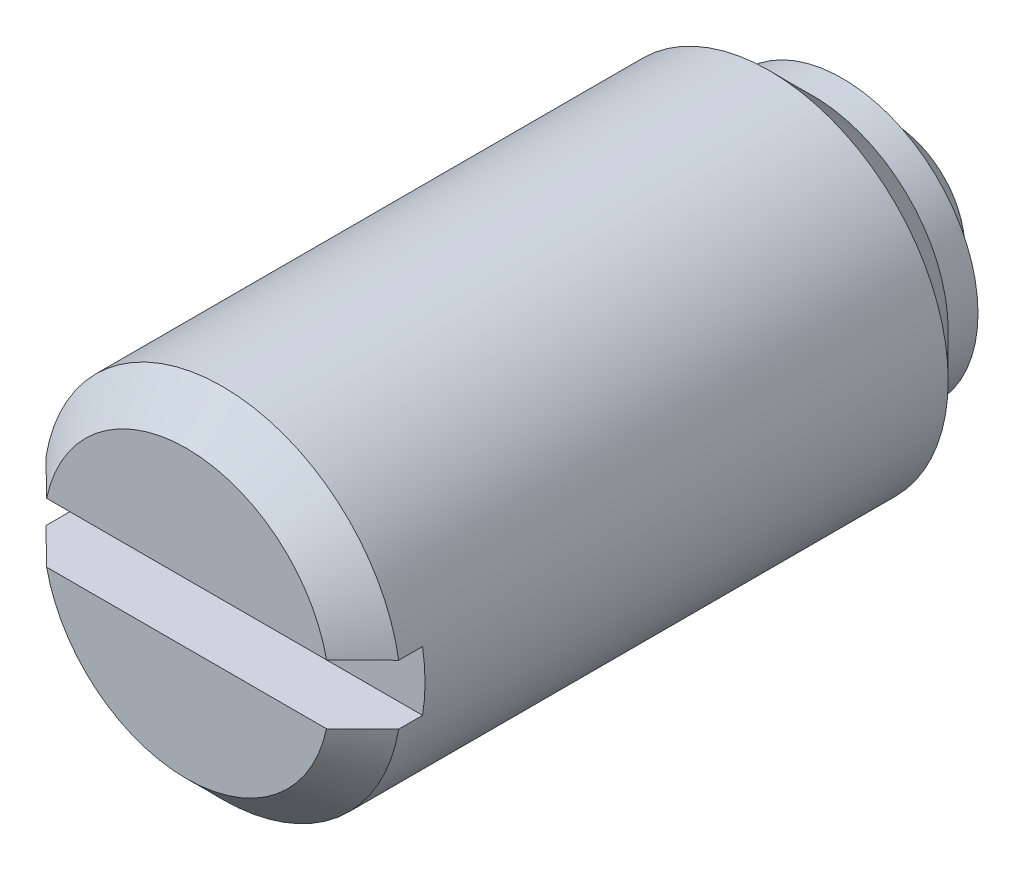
ISO-10303-21;
HEADER;
FILE_DESCRIPTION(('STEP AP214'),'2;1');
FILE_NAME('part.step','',(''),(''),'','','');
FILE_SCHEMA(('AUTOMOTIVE_DESIGN { 1 0 10303 214 1 1 1 1 }'));
ENDSEC;
DATA;
#1=APPLICATION_CONTEXT('core data for automotive mechanical design processes');
#2=APPLICATION_PROTOCOL_DEFINITION('international standard','automotive_design',2000,#1);
#3=PRODUCT_CONTEXT('',#1,'mechanical');
#4=PRODUCT('Part','Part','',(#3));
#5=PRODUCT_RELATED_PRODUCT_CATEGORY('part','',(#4));
#6=PRODUCT_DEFINITION_FORMATION('','',#4);
#7=PRODUCT_DEFINITION_CONTEXT('part definition',#1,'design');
#8=PRODUCT_DEFINITION('design','',#6,#7);
#9=PRODUCT_DEFINITION_SHAPE('','',#8);
#10=(LENGTH_UNIT() NAMED_UNIT(*) SI_UNIT(.MILLI.,.METRE.));
#11=(NAMED_UNIT(*) PLANE_ANGLE_UNIT() SI_UNIT($,.RADIAN.));
#12=(NAMED_UNIT(*) SI_UNIT($,.STERADIAN.) SOLID_ANGLE_UNIT());
#13=UNCERTAINTY_MEASURE_WITH_UNIT(LENGTH_MEASURE(1.E-05),#10,'distance_accuracy_value','');
#14=(GEOMETRIC_REPRESENTATION_CONTEXT(3) GLOBAL_UNCERTAINTY_ASSIGNED_CONTEXT((#13)) GLOBAL_UNIT_ASSIGNED_CONTEXT((#10,
#11,#12)) REPRESENTATION_CONTEXT('',''));
#15=CARTESIAN_POINT('',(0.,0.,0.));
#16=DIRECTION('',(0.,0.,1.));
#17=DIRECTION('',(1.,0.,0.));
#18=AXIS2_PLACEMENT_3D('',#15,#16,#17);
#19=CARTESIAN_POINT('',(0.,0.,-5.5));
#20=DIRECTION('',(0.,0.,-1.));
#21=DIRECTION('',(-1.,0.,0.));
#22=AXIS2_PLACEMENT_3D('',#19,#20,#21);
#23=CYLINDRICAL_SURFACE('',#22,6.);
#24=DIRECTION('',(0.,0.,1.));
#25=VECTOR('',#24,1.);
#26=CARTESIAN_POINT('',(5.91607978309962,-1.,22.5));
#27=LINE('',#26,#25);
#28=CARTESIAN_POINT('',(5.91607978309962,-1.,22.5));
#29=VERTEX_POINT('',#28);
#30=CARTESIAN_POINT('',(5.91607978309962,-1.,23.3));
#31=VERTEX_POINT('',#30);
#32=EDGE_CURVE('E84',#29,#31,#27,.T.);
#33=ORIENTED_EDGE('',*,*,#32,.T.);
#34=CARTESIAN_POINT('',(0.,0.,23.3));
#35=DIRECTION('',(0.,0.,1.));
#36=DIRECTION('',(1.,0.,0.));
#37=AXIS2_PLACEMENT_3D('',#34,#35,#36);
#38=CIRCLE('',#37,6.);
#39=CARTESIAN_POINT('',(-5.91607978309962,-1.,23.3));
#40=VERTEX_POINT('',#39);
#41=EDGE_CURVE('E90',#31,#40,#38,.F.);
#42=ORIENTED_EDGE('',*,*,#41,.T.);
#43=DIRECTION('',(0.,0.,1.));
#44=VECTOR('',#43,1.);
#45=CARTESIAN_POINT('',(-5.91607978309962,-1.,22.5));
#46=LINE('',#45,#44);
#47=CARTESIAN_POINT('',(-5.91607978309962,-1.,22.5));
#48=VERTEX_POINT('',#47);
#49=EDGE_CURVE('E82',#48,#40,#46,.T.);
#50=ORIENTED_EDGE('',*,*,#49,.F.);
#51=CARTESIAN_POINT('',(0.,0.,22.5));
#52=DIRECTION('',(0.,0.,1.));
#53=DIRECTION('',(1.,0.,0.));
#54=AXIS2_PLACEMENT_3D('',#51,#52,#53);
#55=CIRCLE('',#54,6.);
#56=CARTESIAN_POINT('',(-5.91607978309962,1.,22.5));
#57=VERTEX_POINT('',#56);
#58=EDGE_CURVE('E66',#57,#48,#55,.T.);
#59=ORIENTED_EDGE('',*,*,#58,.F.);
#60=DIRECTION('',(0.,0.,1.));
#61=VECTOR('',#60,1.);
#62=CARTESIAN_POINT('',(-5.91607978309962,1.,22.5));
#63=LINE('',#62,#61);
#64=CARTESIAN_POINT('',(-5.91607978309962,1.,23.3));
#65=VERTEX_POINT('',#64);
#66=EDGE_CURVE('E97',#57,#65,#63,.T.);
#67=ORIENTED_EDGE('',*,*,#66,.T.);
#68=CARTESIAN_POINT('',(0.,0.,23.3));
#69=DIRECTION('',(0.,0.,1.));
#70=DIRECTION('',(1.,0.,0.));
#71=AXIS2_PLACEMENT_3D('',#68,#69,#70);
#72=CIRCLE('',#71,6.);
#73=CARTESIAN_POINT('',(5.91607978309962,1.,23.3));
#74=VERTEX_POINT('',#73);
#75=EDGE_CURVE('E102',#65,#74,#72,.F.);
#76=ORIENTED_EDGE('',*,*,#75,.T.);
#77=DIRECTION('',(0.,0.,1.));
#78=VECTOR('',#77,1.);
#79=CARTESIAN_POINT('',(5.91607978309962,1.,22.5));
#80=LINE('',#79,#78);
#81=CARTESIAN_POINT('',(5.91607978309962,1.,22.5));
#82=VERTEX_POINT('',#81);
#83=EDGE_CURVE('E92',#82,#74,#80,.T.);
#84=ORIENTED_EDGE('',*,*,#83,.F.);
#85=EDGE_CURVE('E78',#29,#82,#55,.T.);
#86=ORIENTED_EDGE('',*,*,#85,.F.);
#87=EDGE_LOOP('',(#33,#42,#50,#59,#67,#76,#84,#86));
#88=FACE_BOUND('',#87,.T.);
#89=CARTESIAN_POINT('',(0.,0.,4.95));
#90=DIRECTION('',(0.,0.,1.));
#91=DIRECTION('',(1.,0.,0.));
#92=AXIS2_PLACEMENT_3D('',#89,#90,#91);
#93=CIRCLE('',#92,6.);
#94=CARTESIAN_POINT('',(6.,0.,4.95));
#95=VERTEX_POINT('',#94);
#96=EDGE_CURVE('E166',#95,#95,#93,.T.);
#97=ORIENTED_EDGE('',*,*,#96,.T.);
#98=EDGE_LOOP('',(#97));
#99=FACE_BOUND('',#98,.T.);
#100=ADVANCED_FACE('F15',(#88,#99),#23,.T.);
#101=CARTESIAN_POINT('',(0.,6.,24.5));
#102=DIRECTION('',(0.,0.,1.));
#103=DIRECTION('',(1.,0.,0.));
#104=AXIS2_PLACEMENT_3D('',#101,#102,#103);
#105=PLANE('',#104);
#106=DIRECTION('',(1.,0.,0.));
#107=VECTOR('',#106,1.);
#108=CARTESIAN_POINT('',(-5.91607978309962,1.,24.5));
#109=LINE('',#108,#107);
#110=CARTESIAN_POINT('',(-4.69467783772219,1.,24.5));
#111=VERTEX_POINT('',#110);
#112=CARTESIAN_POINT('',(4.69467783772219,1.,24.5));
#113=VERTEX_POINT('',#112);
#114=EDGE_CURVE('E76',#111,#113,#109,.T.);
#115=ORIENTED_EDGE('',*,*,#114,.T.);
#116=CARTESIAN_POINT('',(0.,0.,24.5));
#117=DIRECTION('',(0.,0.,1.));
#118=DIRECTION('',(1.,0.,0.));
#119=AXIS2_PLACEMENT_3D('',#116,#117,#118);
#120=CIRCLE('',#119,4.8);
#121=EDGE_CURVE('E9',#113,#111,#120,.T.);
#122=ORIENTED_EDGE('',*,*,#121,.T.);
#123=EDGE_LOOP('',(#115,#122));
#124=FACE_BOUND('',#123,.T.);
#125=ADVANCED_FACE('F183',(#124),#105,.T.);
#126=DIRECTION('',(1.,0.,0.));
#127=VECTOR('',#126,1.);
#128=CARTESIAN_POINT('',(-5.91607978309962,-1.,24.5));
#129=LINE('',#128,#127);
#130=CARTESIAN_POINT('',(-4.6946778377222,-1.,24.5));
#131=VERTEX_POINT('',#130);
#132=CARTESIAN_POINT('',(4.6946778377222,-1.,24.5));
#133=VERTEX_POINT('',#132);
#134=EDGE_CURVE('E153',#131,#133,#129,.T.);
#135=ORIENTED_EDGE('',*,*,#134,.F.);
#136=CARTESIAN_POINT('',(0.,0.,24.5));
#137=DIRECTION('',(0.,0.,1.));
#138=DIRECTION('',(1.,0.,0.));
#139=AXIS2_PLACEMENT_3D('',#136,#137,#138);
#140=CIRCLE('',#139,4.8);
#141=EDGE_CURVE('E147',#131,#133,#140,.T.);
#142=ORIENTED_EDGE('',*,*,#141,.T.);
#143=EDGE_LOOP('',(#135,#142));
#144=FACE_BOUND('',#143,.T.);
#145=ADVANCED_FACE('F133',(#144),#105,.T.);
#146=CARTESIAN_POINT('',(-5.91607978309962,1.,22.5));
#147=DIRECTION('',(0.,-1.,0.));
#148=DIRECTION('',(1.,0.,0.));
#149=AXIS2_PLACEMENT_3D('',#146,#147,#148);
#150=PLANE('',#149);
#151=ORIENTED_EDGE('',*,*,#83,.T.);
#152=CARTESIAN_POINT('',(5.91607978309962,1.,23.3));
#153=CARTESIAN_POINT('',(5.81447550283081,1.,23.4001822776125));
#154=CARTESIAN_POINT('',(5.71283625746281,0.999999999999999,23.5003291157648));
#155=CARTESIAN_POINT('',(5.50947387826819,0.999999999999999,23.7005373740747));
#156=CARTESIAN_POINT('',(5.40775074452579,0.999999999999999,23.8005987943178));
#157=CARTESIAN_POINT('',(5.2042063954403,0.999999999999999,24.00062190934));
#158=CARTESIAN_POINT('',(5.10238518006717,0.999999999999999,24.1005836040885));
#159=CARTESIAN_POINT('',(4.89862484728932,0.999999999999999,24.3003869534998));
#160=CARTESIAN_POINT('',(4.79668572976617,1.,24.4002286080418));
#161=CARTESIAN_POINT('',(4.69467783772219,1.,24.5));
#162=B_SPLINE_CURVE_WITH_KNOTS('',3,(#152,#153,#154,#155,#156,#157,#158,#159,#160,#161),
.UNSPECIFIED.,.F.,.F.,(4,2,2,2,4),(0.,0.428064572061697,0.856128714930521,1.28419298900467,
1.71225769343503),.UNSPECIFIED.);
#163=EDGE_CURVE('E24',#74,#113,#162,.T.);
#164=ORIENTED_EDGE('',*,*,#163,.T.);
#165=ORIENTED_EDGE('',*,*,#114,.F.);
#166=CARTESIAN_POINT('',(-4.69467783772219,1.,24.5));
#167=CARTESIAN_POINT('',(-4.79668572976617,1.,24.4002286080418));
#168=CARTESIAN_POINT('',(-4.89862484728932,1.,24.3003869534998));
#169=CARTESIAN_POINT('',(-5.10238518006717,1.,24.1005836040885));
#170=CARTESIAN_POINT('',(-5.2042063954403,1.,24.00062190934));
#171=CARTESIAN_POINT('',(-5.40775074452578,1.,23.8005987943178));
#172=CARTESIAN_POINT('',(-5.50947387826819,1.,23.7005373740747));
#173=CARTESIAN_POINT('',(-5.71283625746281,1.,23.5003291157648));
#174=CARTESIAN_POINT('',(-5.81447550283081,1.,23.4001822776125));
#175=CARTESIAN_POINT('',(-5.91607978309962,1.,23.3));
#176=B_SPLINE_CURVE_WITH_KNOTS('',3,(#166,#167,#168,#169,#170,#171,#172,#173,#174,#175),
.UNSPECIFIED.,.F.,.F.,(4,2,2,2,4),(0.,0.428064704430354,0.856128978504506,1.28419312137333,
1.71225769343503),.UNSPECIFIED.);
#177=EDGE_CURVE('E138',#111,#65,#176,.T.);
#178=ORIENTED_EDGE('',*,*,#177,.T.);
#179=ORIENTED_EDGE('',*,*,#66,.F.);
#180=DIRECTION('',(1.,0.,0.));
#181=VECTOR('',#180,1.);
#182=CARTESIAN_POINT('',(-5.91607978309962,1.,22.5));
#183=LINE('',#182,#181);
#184=EDGE_CURVE('E72',#57,#82,#183,.T.);
#185=ORIENTED_EDGE('',*,*,#184,.T.);
#186=EDGE_LOOP('',(#151,#164,#165,#178,#179,#185));
#187=FACE_BOUND('',#186,.T.);
#188=ADVANCED_FACE('F126',(#187),#150,.T.);
#189=CARTESIAN_POINT('',(-5.91607978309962,-1.,22.5));
#190=DIRECTION('',(0.,-1.,0.));
#191=DIRECTION('',(1.,0.,0.));
#192=AXIS2_PLACEMENT_3D('',#189,#190,#191);
#193=PLANE('',#192);
#194=ORIENTED_EDGE('',*,*,#49,.T.);
#195=CARTESIAN_POINT('',(-5.91607978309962,-1.,23.3));
#196=CARTESIAN_POINT('',(-5.81447550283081,-1.,23.4001822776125));
#197=CARTESIAN_POINT('',(-5.71283625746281,-1.,23.5003291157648));
#198=CARTESIAN_POINT('',(-5.50947387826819,-1.,23.7005373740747));
#199=CARTESIAN_POINT('',(-5.40775074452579,-1.,23.8005987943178));
#200=CARTESIAN_POINT('',(-5.2042063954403,-1.,24.00062190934));
#201=CARTESIAN_POINT('',(-5.10238518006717,-1.,24.1005836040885));
#202=CARTESIAN_POINT('',(-4.89862484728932,-1.,24.3003869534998));
#203=CARTESIAN_POINT('',(-4.79668572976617,-1.,24.4002286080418));
#204=CARTESIAN_POINT('',(-4.6946778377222,-1.,24.5));
#205=B_SPLINE_CURVE_WITH_KNOTS('',3,(#195,#196,#197,#198,#199,#200,#201,#202,#203,#204),
.UNSPECIFIED.,.F.,.F.,(4,2,2,2,4),(0.,0.428064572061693,0.856128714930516,1.28419298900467,
1.71225769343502),.UNSPECIFIED.);
#206=EDGE_CURVE('E113',#40,#131,#205,.T.);
#207=ORIENTED_EDGE('',*,*,#206,.T.);
#208=ORIENTED_EDGE('',*,*,#134,.T.);
#209=CARTESIAN_POINT('',(4.6946778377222,-1.,24.5));
#210=CARTESIAN_POINT('',(4.79668572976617,-1.,24.4002286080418));
#211=CARTESIAN_POINT('',(4.89862484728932,-1.,24.3003869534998));
#212=CARTESIAN_POINT('',(5.10238518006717,-1.,24.1005836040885));
#213=CARTESIAN_POINT('',(5.2042063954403,-1.,24.00062190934));
#214=CARTESIAN_POINT('',(5.40775074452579,-1.,23.8005987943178));
#215=CARTESIAN_POINT('',(5.50947387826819,-1.,23.7005373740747));
#216=CARTESIAN_POINT('',(5.71283625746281,-1.,23.5003291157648));
#217=CARTESIAN_POINT('',(5.81447550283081,-1.,23.4001822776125));
#218=CARTESIAN_POINT('',(5.91607978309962,-1.,23.3));
#219=B_SPLINE_CURVE_WITH_KNOTS('',3,(#209,#210,#211,#212,#213,#214,#215,#216,#217,#218),
.UNSPECIFIED.,.F.,.F.,(4,2,2,2,4),(0.,0.428064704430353,0.856128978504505,1.28419312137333,
1.71225769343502),.UNSPECIFIED.);
#220=EDGE_CURVE('E106',#133,#31,#219,.T.);
#221=ORIENTED_EDGE('',*,*,#220,.T.);
#222=ORIENTED_EDGE('',*,*,#32,.F.);
#223=DIRECTION('',(1.,0.,0.));
#224=VECTOR('',#223,1.);
#225=CARTESIAN_POINT('',(-5.91607978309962,-1.,22.5));
#226=LINE('',#225,#224);
#227=EDGE_CURVE('E69',#48,#29,#226,.T.);
#228=ORIENTED_EDGE('',*,*,#227,.F.);
#229=EDGE_LOOP('',(#194,#207,#208,#221,#222,#228));
#230=FACE_BOUND('',#229,.T.);
#231=ADVANCED_FACE('F81',(#230),#193,.F.);
#232=CARTESIAN_POINT('',(0.,0.,22.5));
#233=DIRECTION('',(0.,0.,1.));
#234=DIRECTION('',(1.,0.,0.));
#235=AXIS2_PLACEMENT_3D('',#232,#233,#234);
#236=PLANE('',#235);
#237=ORIENTED_EDGE('',*,*,#58,.T.);
#238=ORIENTED_EDGE('',*,*,#227,.T.);
#239=ORIENTED_EDGE('',*,*,#85,.T.);
#240=ORIENTED_EDGE('',*,*,#184,.F.);
#241=EDGE_LOOP('',(#237,#238,#239,#240));
#242=FACE_BOUND('',#241,.T.);
#243=ADVANCED_FACE('F68',(#242),#236,.T.);
#244=CARTESIAN_POINT('',(0.,0.,28.6330371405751));
#245=DIRECTION('',(0.,0.,1.));
#246=DIRECTION('',(1.,0.,0.));
#247=AXIS2_PLACEMENT_3D('',#244,#245,#246);
#248=CYLINDRICAL_SURFACE('',#247,4.55);
#249=CARTESIAN_POINT('',(0.,0.,2.5));
#250=DIRECTION('',(0.,0.,1.));
#251=DIRECTION('',(1.,0.,0.));
#252=AXIS2_PLACEMENT_3D('',#249,#250,#251);
#253=CIRCLE('',#252,4.55);
#254=CARTESIAN_POINT('',(4.55,0.,2.5));
#255=VERTEX_POINT('',#254);
#256=EDGE_CURVE('E156',#255,#255,#253,.T.);
#257=ORIENTED_EDGE('',*,*,#256,.T.);
#258=EDGE_LOOP('',(#257));
#259=FACE_BOUND('',#258,.T.);
#260=CARTESIAN_POINT('',(0.,0.,3.5));
#261=DIRECTION('',(0.,0.,1.));
#262=DIRECTION('',(1.,0.,0.));
#263=AXIS2_PLACEMENT_3D('',#260,#261,#262);
#264=CIRCLE('',#263,4.55);
#265=CARTESIAN_POINT('',(4.55,0.,3.5));
#266=VERTEX_POINT('',#265);
#267=EDGE_CURVE('E163',#266,#266,#264,.T.);
#268=ORIENTED_EDGE('',*,*,#267,.F.);
#269=EDGE_LOOP('',(#268));
#270=FACE_BOUND('',#269,.T.);
#271=ADVANCED_FACE('F127',(#259,#270),#248,.T.);
#272=CARTESIAN_POINT('',(0.,0.,4.95));
#273=DIRECTION('',(0.,0.,1.));
#274=DIRECTION('',(1.,0.,0.));
#275=AXIS2_PLACEMENT_3D('',#272,#273,#274);
#276=CONICAL_SURFACE('',#275,6.,0.785398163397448);
#277=ORIENTED_EDGE('',*,*,#267,.T.);
#278=EDGE_LOOP('',(#277));
#279=FACE_BOUND('',#278,.T.);
#280=ORIENTED_EDGE('',*,*,#96,.F.);
#281=EDGE_LOOP('',(#280));
#282=FACE_BOUND('',#281,.T.);
#283=ADVANCED_FACE('F170',(#279,#282),#276,.T.);
#284=CARTESIAN_POINT('',(0.,0.,4.));
#285=DIRECTION('',(-1.,0.,0.));
#286=DIRECTION('',(0.,0.,1.));
#287=AXIS2_PLACEMENT_3D('',#284,#285,#286);
#288=SPHERICAL_SURFACE('',#287,4.);
#289=CARTESIAN_POINT('',(0.,0.,4.));
#290=DIRECTION('',(0.,0.,-1.));
#291=DIRECTION('',(-1.,0.,0.));
#292=AXIS2_PLACEMENT_3D('',#289,#290,#291);
#293=SPHERICAL_SURFACE('',#292,4.);
#294=CARTESIAN_POINT('',(0.,0.,2.5));
#295=DIRECTION('',(0.,0.,-1.));
#296=DIRECTION('',(-1.,0.,0.));
#297=AXIS2_PLACEMENT_3D('',#294,#295,#296);
#298=CIRCLE('',#297,3.70809924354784);
#299=CARTESIAN_POINT('',(-3.70809924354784,0.,2.5));
#300=VERTEX_POINT('',#299);
#301=EDGE_CURVE('E99',#300,#300,#298,.T.);
#302=ORIENTED_EDGE('',*,*,#301,.T.);
#303=EDGE_LOOP('',(#302));
#304=FACE_BOUND('',#303,.T.);
#305=ADVANCED_FACE('F172',(#304),#293,.T.);
#306=CARTESIAN_POINT('',(0.,3.70809924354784,2.5));
#307=DIRECTION('',(0.,0.,-1.));
#308=DIRECTION('',(-1.,0.,0.));
#309=AXIS2_PLACEMENT_3D('',#306,#307,#308);
#310=PLANE('',#309);
#311=ORIENTED_EDGE('',*,*,#301,.F.);
#312=EDGE_LOOP('',(#311));
#313=FACE_BOUND('',#312,.T.);
#314=ORIENTED_EDGE('',*,*,#256,.F.);
#315=EDGE_LOOP('',(#314));
#316=FACE_BOUND('',#315,.T.);
#317=ADVANCED_FACE('F134',(#313,#316),#310,.T.);
#318=CARTESIAN_POINT('',(0.,0.,23.3));
#319=DIRECTION('',(0.,0.,-1.));
#320=DIRECTION('',(-1.,0.,0.));
#321=AXIS2_PLACEMENT_3D('',#318,#319,#320);
#322=CONICAL_SURFACE('',#321,6.,0.785398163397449);
#323=ORIENTED_EDGE('',*,*,#220,.F.);
#324=ORIENTED_EDGE('',*,*,#141,.F.);
#325=ORIENTED_EDGE('',*,*,#206,.F.);
#326=ORIENTED_EDGE('',*,*,#41,.F.);
#327=EDGE_LOOP('',(#323,#324,#325,#326));
#328=FACE_BOUND('',#327,.T.);
#329=ADVANCED_FACE('F119',(#328),#322,.T.);
#330=CARTESIAN_POINT('',(0.,0.,23.3));
#331=DIRECTION('',(0.,0.,-1.));
#332=DIRECTION('',(-1.,0.,0.));
#333=AXIS2_PLACEMENT_3D('',#330,#331,#332);
#334=CONICAL_SURFACE('',#333,6.,0.78539816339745);
#335=ORIENTED_EDGE('',*,*,#177,.F.);
#336=ORIENTED_EDGE('',*,*,#121,.F.);
#337=ORIENTED_EDGE('',*,*,#163,.F.);
#338=ORIENTED_EDGE('',*,*,#75,.F.);
#339=EDGE_LOOP('',(#335,#336,#337,#338));
#340=FACE_BOUND('',#339,.T.);
#341=ADVANCED_FACE('F17',(#340),#334,.T.);
#342=CLOSED_SHELL('',(#100,#125,#145,#188,#231,#243,#271,#283,#305,#317,#329,#341));
#343=MANIFOLD_SOLID_BREP('B1',#342);
#344=ADVANCED_BREP_SHAPE_REPRESENTATION('',(#18,#343),#14);
#345=SHAPE_DEFINITION_REPRESENTATION(#9,#344);
ENDSEC;
END-ISO-10303-21;
